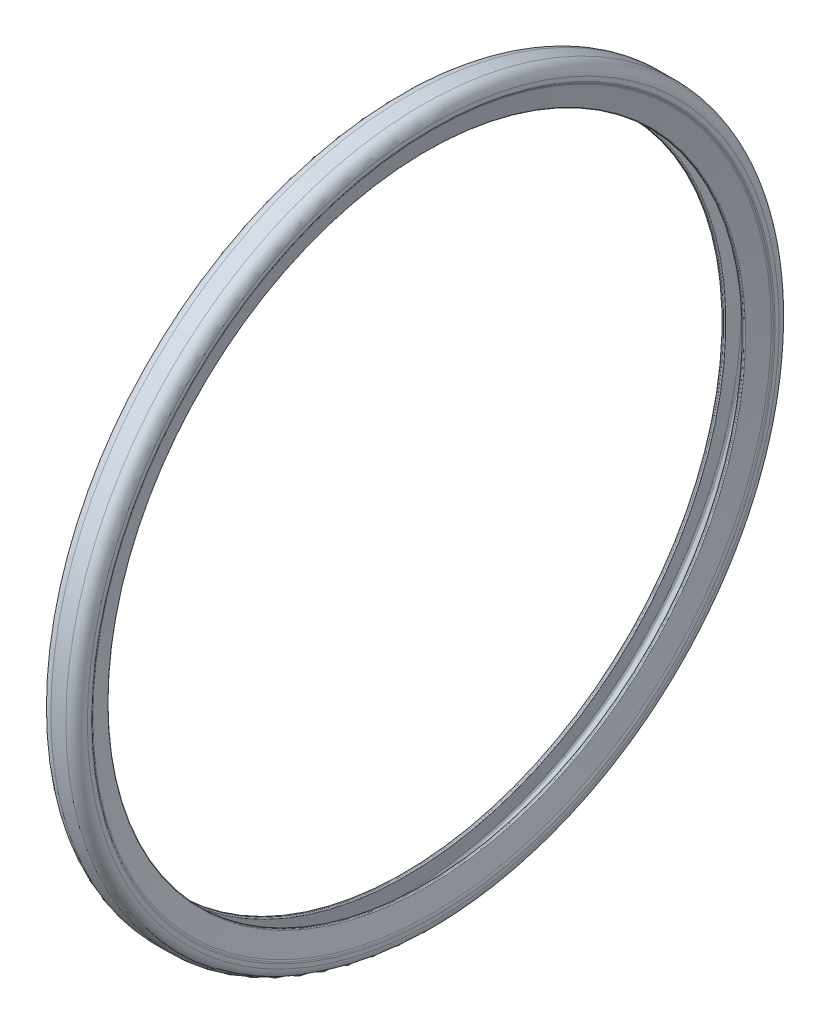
from build123d import *


with BuildPart() as part:
    # Sketch2 → Revolve3 (revolve)
    with BuildSketch(Plane.XY, mode=Mode.PRIVATE) as revolve3_sk:
        with BuildLine():
            Line((-10.886565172, 7.695918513), (-15.927669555, 26.610768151))
            ThreePointArc((-15.927669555, 26.610768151), (-16.191963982, 27.307607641), (-16.592015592, 27.936412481))
            ThreePointArc((-16.592015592, 27.936412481), (-16.89316677, 28.485700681), (-16.997398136, 29.10339428))
            Line((-16.997398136, 29.10339428), (-16.997398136, 32.860984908))
            ThreePointArc((-16.997398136, 32.860984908), (-14.068465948, 39.93205272), (-6.997398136, 42.860984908))
            Line((-6.997398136, 42.860984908), (6.997398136, 42.860984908))
            ThreePointArc((6.997398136, 42.860984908), (14.068465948, 39.93205272), (16.997398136, 32.860984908))
            Line((16.997398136, 32.860984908), (16.997398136, 29.10339428))
            ThreePointArc((16.997398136, 29.10339428), (16.89316677, 28.485700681), (16.592015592, 27.936412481))
            ThreePointArc((16.592015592, 27.936412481), (16.191963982, 27.307607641), (15.927669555, 26.610768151))
            Line((15.927669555, 26.610768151), (10.886565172, 7.695918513))
            ThreePointArc((10.886565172, 7.695918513), (10.529585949, 7.160499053), (9.920293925, 6.953444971))
            Line((9.920293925, 6.953444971), (8.885387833, 6.953444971))
            ThreePointArc((8.885387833, 6.953444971), (8.092441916, 7.344152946), (7.919116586, 8.210971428))
            Line((7.919116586, 8.210971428), (13.379556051, 28.69921837))
            ThreePointArc((13.379556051, 28.69921837), (13.289741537, 29.875659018), (12.552414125, 30.796760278))
            ThreePointArc((12.552414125, 30.796760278), (-0.136328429, 34.355186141), (-12.411160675, 29.559868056))
            ThreePointArc((-12.411160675, 29.559868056), (-13.036037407, 28.62954988), (-13.062387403, 27.509162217))
            Line((-13.062387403, 27.509162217), (-7.919116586, 8.210971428))
            ThreePointArc((-7.919116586, 8.210971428), (-8.092441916, 7.344152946), (-8.885387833, 6.953444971))
            Line((-8.885387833, 6.953444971), (-9.920293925, 6.953444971))
            ThreePointArc((-9.920293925, 6.953444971), (-10.529585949, 7.160499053), (-10.886565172, 7.695918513))
        make_face()
    revolve(revolve3_sk.sketch.rotate(Axis((-43.107593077, -289.525905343, 0), (1, 0, 0)), 90), axis=Axis((-43.107593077, -289.525905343, 0), (1, 0, 0)))


solid = part.part
